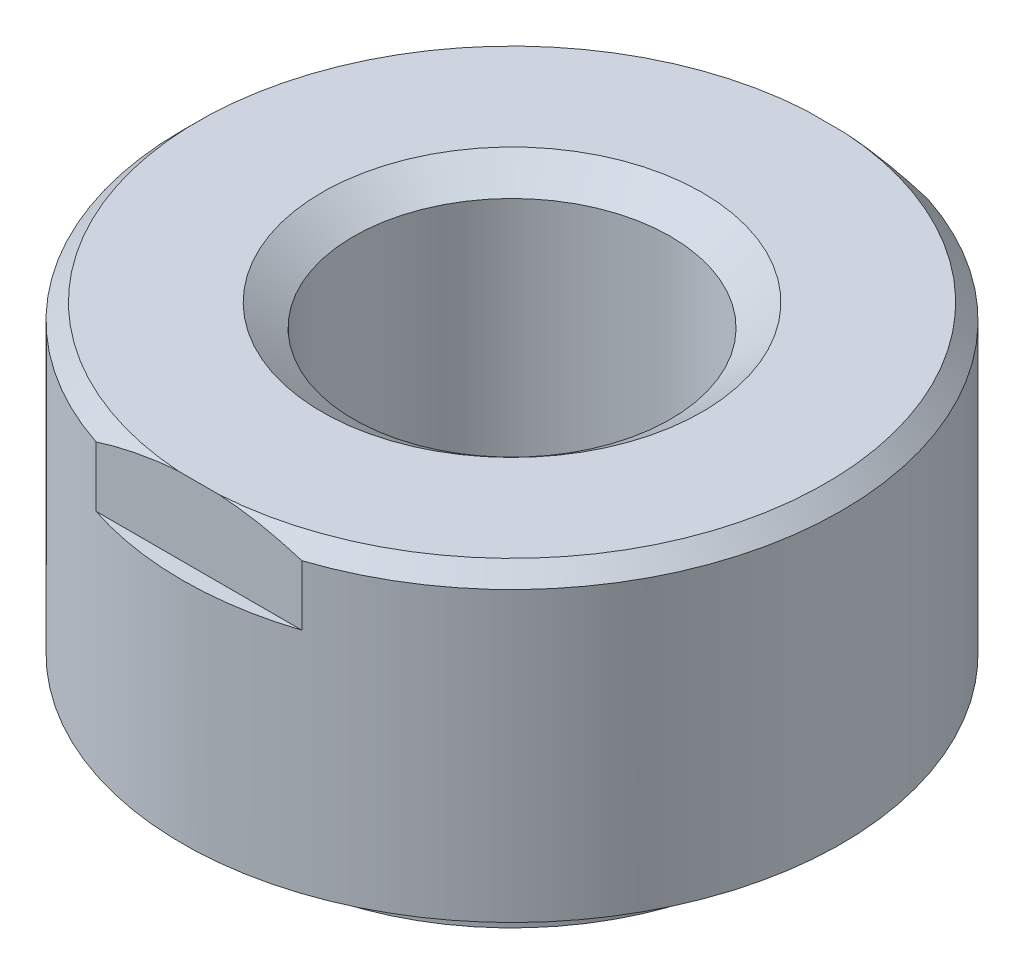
from build123d import *

# Parameters (mm, degrees)
CHAMFER_2_SIZE        = 0.396875
FLATSSKE_W            = 16.51
FLATSSKE_H            = 0.8255
FLATS_DEPTH           = 1.905
CLICUTSKE_R           = 0.8255
CLINCHINGCUT_DEPTH    = 0.58928
CLINCHINGCUTPAT_COUNT = 24
CLINCHINGCUTPAT_ANGLE = 345


with BuildPart() as part:
    # BodySke → Body (revolve)
    with BuildSketch(Plane.XY, mode=Mode.PRIVATE) as body_sk:
        Polygon((5.900292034, 0), (6.3373, 0), (6.3373, -0.58928), (7.29615, -0.58928), (7.29615, 0), (8.255, 0), (8.255, 7.62), (3.96875, 7.62), (3.96875, -1.4732), (6.3373, -1.4732), (6.3373, -1.3462), (5.900292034, -0.58928), align=None)
    revolve(body_sk.sketch.rotate(Axis((0, 0, 0), (0, 1, 0)), 90), axis=Axis((0, 0, 0), (0, 1, 0)))

    # Chamfer 2
    chamfer_2_edges = [part.edges().sort_by_distance(p)[0] for p in [
        (0, 7.62, 8.255),
    ]]
    chamfer(chamfer_2_edges, length=CHAMFER_2_SIZE)

    # FlatsSke → Flats (cut)
    with BuildSketch(Plane(origin=(0, 7.62, 0), x_dir=(-1, 0, 0), z_dir=(0, 1, 0))):
        with Locations((0, 8.255)):
            Rectangle(FLATSSKE_W, FLATSSKE_H)
        with Locations((0, -8.255)):
            Rectangle(FLATSSKE_W, FLATSSKE_H)
    extrude(amount=-FLATS_DEPTH, mode=Mode.SUBTRACT)

    # EndChamferSke → EndChamfer (revolve, cut)
    with BuildSketch(Plane.XY, mode=Mode.PRIVATE) as endchamfer_sk:
        Polygon((4.7625, -1.7272), (4.7625, -1.47066), (3.96875, -0.915076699), (3.96875, -1.7272), align=None)
        Polygon((4.7625, 7.62), (3.96875, 7.064416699), (3.96875, 7.62), align=None)
    revolve(endchamfer_sk.sketch.rotate(Axis((0, -2.54, 0), (0, 1, 0)), 90), axis=Axis((0, -2.54, 0), (0, 1, 0)), mode=Mode.SUBTRACT)

    # CliCutSke → ClinchingCut (cut)
    with BuildSketch(Plane.XZ.offset(0.58928)):
        with Locations((0.952338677, 7.233730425)):
            Circle(CLICUTSKE_R)
    clinchingcut = extrude(amount=-CLINCHINGCUT_DEPTH, mode=Mode.SUBTRACT)

    # ClinchingCutPat: ClinchingCut ×24 about axis
    clinchingcutpat_axis = Axis((0, 0, 0), (0, 1, 0))
    for i in range(1, CLINCHINGCUTPAT_COUNT):
        add(clinchingcut.rotate(clinchingcutpat_axis, i * CLINCHINGCUTPAT_ANGLE / (CLINCHINGCUTPAT_COUNT - 1)), mode=Mode.SUBTRACT)


solid = part.part
